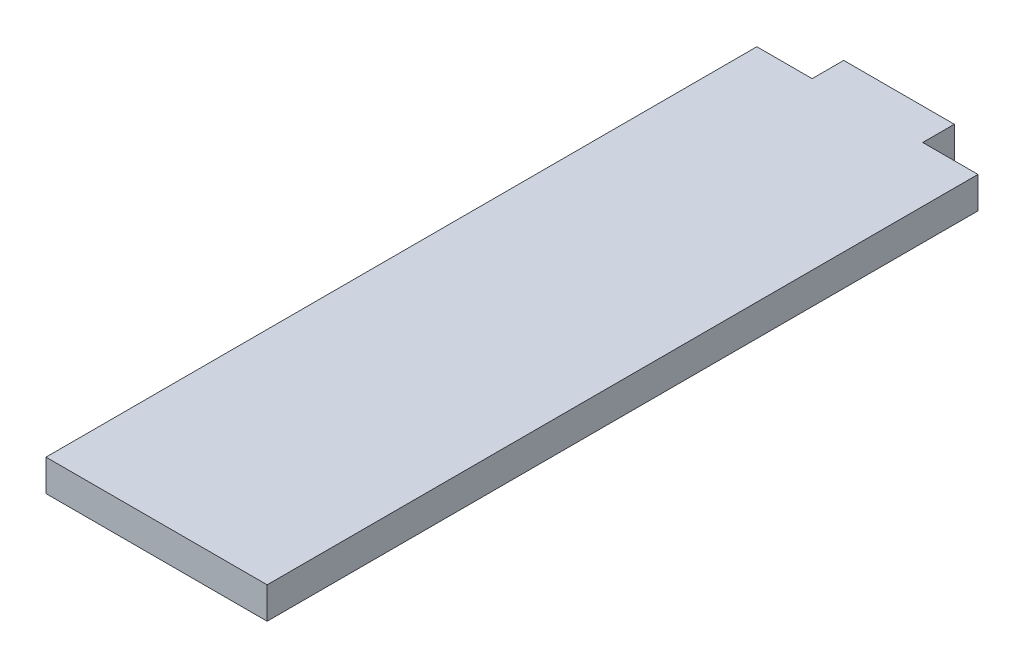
ISO-10303-21;
HEADER;
FILE_DESCRIPTION(('STEP AP214'),'2;1');
FILE_NAME('part.step','',(''),(''),'','','');
FILE_SCHEMA(('AUTOMOTIVE_DESIGN { 1 0 10303 214 1 1 1 1 }'));
ENDSEC;
DATA;
#1=APPLICATION_CONTEXT('core data for automotive mechanical design processes');
#2=APPLICATION_PROTOCOL_DEFINITION('international standard','automotive_design',2000,#1);
#3=PRODUCT_CONTEXT('',#1,'mechanical');
#4=PRODUCT('Part','Part','',(#3));
#5=PRODUCT_RELATED_PRODUCT_CATEGORY('part','',(#4));
#6=PRODUCT_DEFINITION_FORMATION('','',#4);
#7=PRODUCT_DEFINITION_CONTEXT('part definition',#1,'design');
#8=PRODUCT_DEFINITION('design','',#6,#7);
#9=PRODUCT_DEFINITION_SHAPE('','',#8);
#10=(LENGTH_UNIT() NAMED_UNIT(*) SI_UNIT(.MILLI.,.METRE.));
#11=(NAMED_UNIT(*) PLANE_ANGLE_UNIT() SI_UNIT($,.RADIAN.));
#12=(NAMED_UNIT(*) SI_UNIT($,.STERADIAN.) SOLID_ANGLE_UNIT());
#13=UNCERTAINTY_MEASURE_WITH_UNIT(LENGTH_MEASURE(1.E-05),#10,'distance_accuracy_value','');
#14=(GEOMETRIC_REPRESENTATION_CONTEXT(3) GLOBAL_UNCERTAINTY_ASSIGNED_CONTEXT((#13)) GLOBAL_UNIT_ASSIGNED_CONTEXT((#10,
#11,#12)) REPRESENTATION_CONTEXT('',''));
#15=CARTESIAN_POINT('',(0.,0.,0.));
#16=DIRECTION('',(0.,0.,1.));
#17=DIRECTION('',(1.,0.,0.));
#18=AXIS2_PLACEMENT_3D('',#15,#16,#17);
#19=CARTESIAN_POINT('',(-7.,2.,-45.));
#20=DIRECTION('',(1.,0.,0.));
#21=DIRECTION('',(0.,0.,-1.));
#22=AXIS2_PLACEMENT_3D('',#19,#20,#21);
#23=PLANE('',#22);
#24=DIRECTION('',(0.,0.,1.));
#25=VECTOR('',#24,1.);
#26=CARTESIAN_POINT('',(-7.,0.,-45.));
#27=LINE('',#26,#25);
#28=CARTESIAN_POINT('',(-7.,0.,-45.));
#29=VERTEX_POINT('',#28);
#30=CARTESIAN_POINT('',(-7.00000000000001,0.,0.));
#31=VERTEX_POINT('',#30);
#32=EDGE_CURVE('E144',#29,#31,#27,.T.);
#33=ORIENTED_EDGE('',*,*,#32,.T.);
#34=DIRECTION('',(0.,-1.,0.));
#35=VECTOR('',#34,1.);
#36=CARTESIAN_POINT('',(-7.00000000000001,2.,0.));
#37=LINE('',#36,#35);
#38=CARTESIAN_POINT('',(-7.00000000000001,2.,0.));
#39=VERTEX_POINT('',#38);
#40=EDGE_CURVE('E11',#39,#31,#37,.T.);
#41=ORIENTED_EDGE('',*,*,#40,.F.);
#42=DIRECTION('',(0.,0.,1.));
#43=VECTOR('',#42,1.);
#44=CARTESIAN_POINT('',(-7.,2.,-45.));
#45=LINE('',#44,#43);
#46=CARTESIAN_POINT('',(-7.,2.,-45.));
#47=VERTEX_POINT('',#46);
#48=EDGE_CURVE('E166',#47,#39,#45,.T.);
#49=ORIENTED_EDGE('',*,*,#48,.F.);
#50=DIRECTION('',(0.,-1.,0.));
#51=VECTOR('',#50,1.);
#52=CARTESIAN_POINT('',(-7.,2.,-45.));
#53=LINE('',#52,#51);
#54=EDGE_CURVE('E140',#47,#29,#53,.T.);
#55=ORIENTED_EDGE('',*,*,#54,.T.);
#56=EDGE_LOOP('',(#33,#41,#49,#55));
#57=FACE_BOUND('',#56,.T.);
#58=ADVANCED_FACE('F43',(#57),#23,.F.);
#59=CARTESIAN_POINT('',(7.00000000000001,2.,0.));
#60=DIRECTION('',(0.,0.,-1.));
#61=DIRECTION('',(-1.,0.,0.));
#62=AXIS2_PLACEMENT_3D('',#59,#60,#61);
#63=PLANE('',#62);
#64=DIRECTION('',(1.,0.,0.));
#65=VECTOR('',#64,1.);
#66=CARTESIAN_POINT('',(7.00000000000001,0.,0.));
#67=LINE('',#66,#65);
#68=CARTESIAN_POINT('',(7.00000000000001,0.,0.));
#69=VERTEX_POINT('',#68);
#70=EDGE_CURVE('E148',#31,#69,#67,.T.);
#71=ORIENTED_EDGE('',*,*,#70,.T.);
#72=DIRECTION('',(0.,-1.,0.));
#73=VECTOR('',#72,1.);
#74=CARTESIAN_POINT('',(7.00000000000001,2.,0.));
#75=LINE('',#74,#73);
#76=CARTESIAN_POINT('',(7.00000000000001,2.,0.));
#77=VERTEX_POINT('',#76);
#78=EDGE_CURVE('E52',#77,#69,#75,.T.);
#79=ORIENTED_EDGE('',*,*,#78,.F.);
#80=DIRECTION('',(1.,0.,0.));
#81=VECTOR('',#80,1.);
#82=CARTESIAN_POINT('',(7.00000000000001,2.,0.));
#83=LINE('',#82,#81);
#84=EDGE_CURVE('E103',#39,#77,#83,.T.);
#85=ORIENTED_EDGE('',*,*,#84,.F.);
#86=ORIENTED_EDGE('',*,*,#40,.T.);
#87=EDGE_LOOP('',(#71,#79,#85,#86));
#88=FACE_BOUND('',#87,.T.);
#89=ADVANCED_FACE('F212',(#88),#63,.F.);
#90=CARTESIAN_POINT('',(7.,2.,-45.));
#91=DIRECTION('',(-1.,0.,0.));
#92=DIRECTION('',(0.,0.,1.));
#93=AXIS2_PLACEMENT_3D('',#90,#91,#92);
#94=PLANE('',#93);
#95=DIRECTION('',(0.,0.,-1.));
#96=VECTOR('',#95,1.);
#97=CARTESIAN_POINT('',(7.,0.,-45.));
#98=LINE('',#97,#96);
#99=CARTESIAN_POINT('',(7.,0.,-45.));
#100=VERTEX_POINT('',#99);
#101=EDGE_CURVE('E151',#69,#100,#98,.T.);
#102=ORIENTED_EDGE('',*,*,#101,.T.);
#103=DIRECTION('',(0.,-1.,0.));
#104=VECTOR('',#103,1.);
#105=CARTESIAN_POINT('',(7.,2.,-45.));
#106=LINE('',#105,#104);
#107=CARTESIAN_POINT('',(7.,2.,-45.));
#108=VERTEX_POINT('',#107);
#109=EDGE_CURVE('E177',#108,#100,#106,.T.);
#110=ORIENTED_EDGE('',*,*,#109,.F.);
#111=DIRECTION('',(0.,0.,-1.));
#112=VECTOR('',#111,1.);
#113=CARTESIAN_POINT('',(7.,2.,-45.));
#114=LINE('',#113,#112);
#115=EDGE_CURVE('E187',#77,#108,#114,.T.);
#116=ORIENTED_EDGE('',*,*,#115,.F.);
#117=ORIENTED_EDGE('',*,*,#78,.T.);
#118=EDGE_LOOP('',(#102,#110,#116,#117));
#119=FACE_BOUND('',#118,.T.);
#120=ADVANCED_FACE('F185',(#119),#94,.F.);
#121=CARTESIAN_POINT('',(3.5,2.,-45.));
#122=DIRECTION('',(0.,0.,1.));
#123=DIRECTION('',(1.,0.,0.));
#124=AXIS2_PLACEMENT_3D('',#121,#122,#123);
#125=PLANE('',#124);
#126=DIRECTION('',(-1.,0.,0.));
#127=VECTOR('',#126,1.);
#128=CARTESIAN_POINT('',(3.5,0.,-45.));
#129=LINE('',#128,#127);
#130=CARTESIAN_POINT('',(3.5,0.,-45.));
#131=VERTEX_POINT('',#130);
#132=EDGE_CURVE('E154',#100,#131,#129,.T.);
#133=ORIENTED_EDGE('',*,*,#132,.T.);
#134=DIRECTION('',(0.,-1.,0.));
#135=VECTOR('',#134,1.);
#136=CARTESIAN_POINT('',(3.5,2.,-45.));
#137=LINE('',#136,#135);
#138=CARTESIAN_POINT('',(3.5,2.,-45.));
#139=VERTEX_POINT('',#138);
#140=EDGE_CURVE('E173',#139,#131,#137,.T.);
#141=ORIENTED_EDGE('',*,*,#140,.F.);
#142=DIRECTION('',(-1.,0.,0.));
#143=VECTOR('',#142,1.);
#144=CARTESIAN_POINT('',(3.5,2.,-45.));
#145=LINE('',#144,#143);
#146=EDGE_CURVE('E200',#108,#139,#145,.T.);
#147=ORIENTED_EDGE('',*,*,#146,.F.);
#148=ORIENTED_EDGE('',*,*,#109,.T.);
#149=EDGE_LOOP('',(#133,#141,#147,#148));
#150=FACE_BOUND('',#149,.T.);
#151=ADVANCED_FACE('F195',(#150),#125,.F.);
#152=CARTESIAN_POINT('',(3.5,2.,-47.));
#153=DIRECTION('',(-1.,0.,0.));
#154=DIRECTION('',(0.,0.,1.));
#155=AXIS2_PLACEMENT_3D('',#152,#153,#154);
#156=PLANE('',#155);
#157=DIRECTION('',(0.,0.,-1.));
#158=VECTOR('',#157,1.);
#159=CARTESIAN_POINT('',(3.5,0.,-47.));
#160=LINE('',#159,#158);
#161=CARTESIAN_POINT('',(3.5,0.,-47.));
#162=VERTEX_POINT('',#161);
#163=EDGE_CURVE('E157',#131,#162,#160,.T.);
#164=ORIENTED_EDGE('',*,*,#163,.T.);
#165=DIRECTION('',(0.,-1.,0.));
#166=VECTOR('',#165,1.);
#167=CARTESIAN_POINT('',(3.5,2.,-47.));
#168=LINE('',#167,#166);
#169=CARTESIAN_POINT('',(3.5,2.,-47.));
#170=VERTEX_POINT('',#169);
#171=EDGE_CURVE('E133',#170,#162,#168,.T.);
#172=ORIENTED_EDGE('',*,*,#171,.F.);
#173=DIRECTION('',(0.,0.,-1.));
#174=VECTOR('',#173,1.);
#175=CARTESIAN_POINT('',(3.5,2.,-47.));
#176=LINE('',#175,#174);
#177=EDGE_CURVE('E122',#139,#170,#176,.T.);
#178=ORIENTED_EDGE('',*,*,#177,.F.);
#179=ORIENTED_EDGE('',*,*,#140,.T.);
#180=EDGE_LOOP('',(#164,#172,#178,#179));
#181=FACE_BOUND('',#180,.T.);
#182=ADVANCED_FACE('F198',(#181),#156,.F.);
#183=CARTESIAN_POINT('',(-3.5,2.,-47.));
#184=DIRECTION('',(0.,0.,1.));
#185=DIRECTION('',(1.,0.,0.));
#186=AXIS2_PLACEMENT_3D('',#183,#184,#185);
#187=PLANE('',#186);
#188=DIRECTION('',(-1.,0.,0.));
#189=VECTOR('',#188,1.);
#190=CARTESIAN_POINT('',(-3.5,0.,-47.));
#191=LINE('',#190,#189);
#192=CARTESIAN_POINT('',(-3.5,0.,-47.));
#193=VERTEX_POINT('',#192);
#194=EDGE_CURVE('E131',#162,#193,#191,.T.);
#195=ORIENTED_EDGE('',*,*,#194,.T.);
#196=DIRECTION('',(0.,-1.,0.));
#197=VECTOR('',#196,1.);
#198=CARTESIAN_POINT('',(-3.5,2.,-47.));
#199=LINE('',#198,#197);
#200=CARTESIAN_POINT('',(-3.5,2.,-47.));
#201=VERTEX_POINT('',#200);
#202=EDGE_CURVE('E128',#201,#193,#199,.T.);
#203=ORIENTED_EDGE('',*,*,#202,.F.);
#204=DIRECTION('',(-1.,0.,0.));
#205=VECTOR('',#204,1.);
#206=CARTESIAN_POINT('',(-3.5,2.,-47.));
#207=LINE('',#206,#205);
#208=EDGE_CURVE('E116',#170,#201,#207,.T.);
#209=ORIENTED_EDGE('',*,*,#208,.F.);
#210=ORIENTED_EDGE('',*,*,#171,.T.);
#211=EDGE_LOOP('',(#195,#203,#209,#210));
#212=FACE_BOUND('',#211,.T.);
#213=ADVANCED_FACE('F129',(#212),#187,.F.);
#214=CARTESIAN_POINT('',(-3.5,2.,-47.));
#215=DIRECTION('',(1.,0.,0.));
#216=DIRECTION('',(0.,0.,-1.));
#217=AXIS2_PLACEMENT_3D('',#214,#215,#216);
#218=PLANE('',#217);
#219=DIRECTION('',(0.,0.,1.));
#220=VECTOR('',#219,1.);
#221=CARTESIAN_POINT('',(-3.5,0.,-47.));
#222=LINE('',#221,#220);
#223=CARTESIAN_POINT('',(-3.5,0.,-45.));
#224=VERTEX_POINT('',#223);
#225=EDGE_CURVE('E89',#193,#224,#222,.T.);
#226=ORIENTED_EDGE('',*,*,#225,.T.);
#227=DIRECTION('',(0.,-1.,0.));
#228=VECTOR('',#227,1.);
#229=CARTESIAN_POINT('',(-3.5,2.,-45.));
#230=LINE('',#229,#228);
#231=CARTESIAN_POINT('',(-3.5,2.,-45.));
#232=VERTEX_POINT('',#231);
#233=EDGE_CURVE('E134',#232,#224,#230,.T.);
#234=ORIENTED_EDGE('',*,*,#233,.F.);
#235=DIRECTION('',(0.,0.,1.));
#236=VECTOR('',#235,1.);
#237=CARTESIAN_POINT('',(-3.5,2.,-47.));
#238=LINE('',#237,#236);
#239=EDGE_CURVE('E120',#201,#232,#238,.T.);
#240=ORIENTED_EDGE('',*,*,#239,.F.);
#241=ORIENTED_EDGE('',*,*,#202,.T.);
#242=EDGE_LOOP('',(#226,#234,#240,#241));
#243=FACE_BOUND('',#242,.T.);
#244=ADVANCED_FACE('F136',(#243),#218,.F.);
#245=CARTESIAN_POINT('',(-3.5,2.,-45.));
#246=DIRECTION('',(0.,0.,1.));
#247=DIRECTION('',(1.,0.,0.));
#248=AXIS2_PLACEMENT_3D('',#245,#246,#247);
#249=PLANE('',#248);
#250=DIRECTION('',(-1.,0.,0.));
#251=VECTOR('',#250,1.);
#252=CARTESIAN_POINT('',(-3.5,0.,-45.));
#253=LINE('',#252,#251);
#254=EDGE_CURVE('E95',#224,#29,#253,.T.);
#255=ORIENTED_EDGE('',*,*,#254,.T.);
#256=ORIENTED_EDGE('',*,*,#54,.F.);
#257=DIRECTION('',(-1.,0.,0.));
#258=VECTOR('',#257,1.);
#259=CARTESIAN_POINT('',(-3.5,2.,-45.));
#260=LINE('',#259,#258);
#261=EDGE_CURVE('E60',#232,#47,#260,.T.);
#262=ORIENTED_EDGE('',*,*,#261,.F.);
#263=ORIENTED_EDGE('',*,*,#233,.T.);
#264=EDGE_LOOP('',(#255,#256,#262,#263));
#265=FACE_BOUND('',#264,.T.);
#266=ADVANCED_FACE('F228',(#265),#249,.F.);
#267=CARTESIAN_POINT('',(0.,2.,0.));
#268=DIRECTION('',(0.,-1.,0.));
#269=DIRECTION('',(0.,0.,-1.));
#270=AXIS2_PLACEMENT_3D('',#267,#268,#269);
#271=PLANE('',#270);
#272=ORIENTED_EDGE('',*,*,#48,.T.);
#273=ORIENTED_EDGE('',*,*,#84,.T.);
#274=ORIENTED_EDGE('',*,*,#115,.T.);
#275=ORIENTED_EDGE('',*,*,#146,.T.);
#276=ORIENTED_EDGE('',*,*,#177,.T.);
#277=ORIENTED_EDGE('',*,*,#208,.T.);
#278=ORIENTED_EDGE('',*,*,#239,.T.);
#279=ORIENTED_EDGE('',*,*,#261,.T.);
#280=EDGE_LOOP('',(#272,#273,#274,#275,#276,#277,#278,#279));
#281=FACE_BOUND('',#280,.T.);
#282=ADVANCED_FACE('F118',(#281),#271,.F.);
#283=CARTESIAN_POINT('',(0.,0.,0.));
#284=DIRECTION('',(0.,-1.,0.));
#285=DIRECTION('',(0.,0.,-1.));
#286=AXIS2_PLACEMENT_3D('',#283,#284,#285);
#287=PLANE('',#286);
#288=ORIENTED_EDGE('',*,*,#32,.F.);
#289=ORIENTED_EDGE('',*,*,#254,.F.);
#290=ORIENTED_EDGE('',*,*,#225,.F.);
#291=ORIENTED_EDGE('',*,*,#194,.F.);
#292=ORIENTED_EDGE('',*,*,#163,.F.);
#293=ORIENTED_EDGE('',*,*,#132,.F.);
#294=ORIENTED_EDGE('',*,*,#101,.F.);
#295=ORIENTED_EDGE('',*,*,#70,.F.);
#296=EDGE_LOOP('',(#288,#289,#290,#291,#292,#293,#294,#295));
#297=FACE_BOUND('',#296,.T.);
#298=ADVANCED_FACE('F191',(#297),#287,.T.);
#299=CLOSED_SHELL('',(#58,#89,#120,#151,#182,#213,#244,#266,#282,#298));
#300=MANIFOLD_SOLID_BREP('B2',#299);
#301=ADVANCED_BREP_SHAPE_REPRESENTATION('',(#18,#300),#14);
#302=SHAPE_DEFINITION_REPRESENTATION(#9,#301);
ENDSEC;
END-ISO-10303-21;
